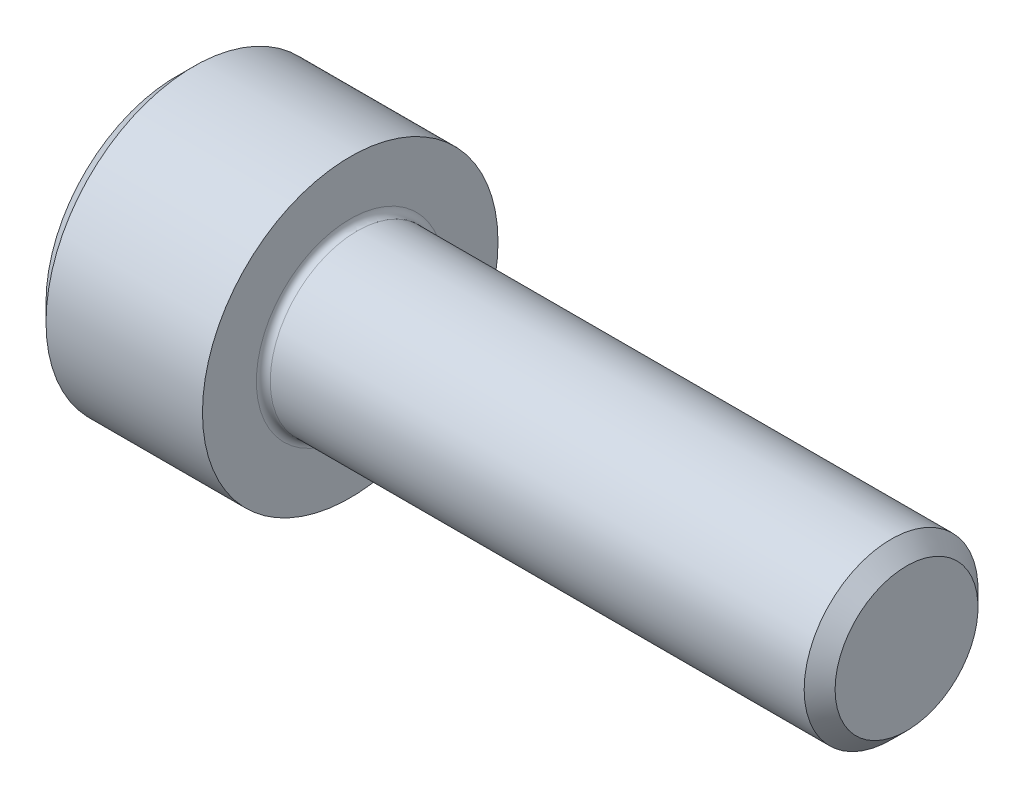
from build123d import *

# Parameters (mm, degrees)
FILLET1_R   = 0.2
HEX_2_DEPTH = 2.5


with BuildPart() as part:
    # BodySke → Base-Revolve (revolve)
    with BuildSketch(Plane.XY, mode=Mode.PRIVATE) as base_revolve_sk:
        Polygon((0, 0), (0, 3.75), (0.5, 4.25), (5, 4.25), (5, 2.5), (20.555, 2.5), (21, 2.055), (21, 0), align=None)
    revolve(base_revolve_sk.sketch.rotate(Axis((-31.75, 0, 0), (1, 0, 0)), 90), axis=Axis((-31.75, 0, 0), (1, 0, 0)))

    # Fillet1
    fillet1_edges = [part.edges().sort_by_distance(p)[0] for p in [
        (5, 0, -2.5),
    ]]
    fillet(fillet1_edges, radius=FILLET1_R)

    # Sketch2 → Hex-PreBroach (revolve, cut)
    with BuildSketch(Plane.XY, mode=Mode.PRIVATE) as hex_prebroach_sk:
        Polygon((0, 2.042), (2.5, 2.042), (3.67894925, 0), (0, 0), align=None)
    revolve(hex_prebroach_sk.sketch.rotate(Axis((0, 0, 0), (1, 0, 0)), 90), axis=Axis((0, 0, 0), (1, 0, 0)), mode=Mode.SUBTRACT)

    # Sketch3 → Hex 2 (cut)
    with BuildSketch(Plane(origin=(0, 0, 0), x_dir=(0, 0.500000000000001, 0.866025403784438), z_dir=(-1, 0, 0))):
        Polygon((1.17894925, 2.042), (-1.17894925, 2.042), (-2.357898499, 0), (-1.17894925, -2.042), (1.17894925, -2.042), (2.357898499, 0), align=None)
    extrude(amount=-HEX_2_DEPTH, mode=Mode.SUBTRACT)


solid = part.part
